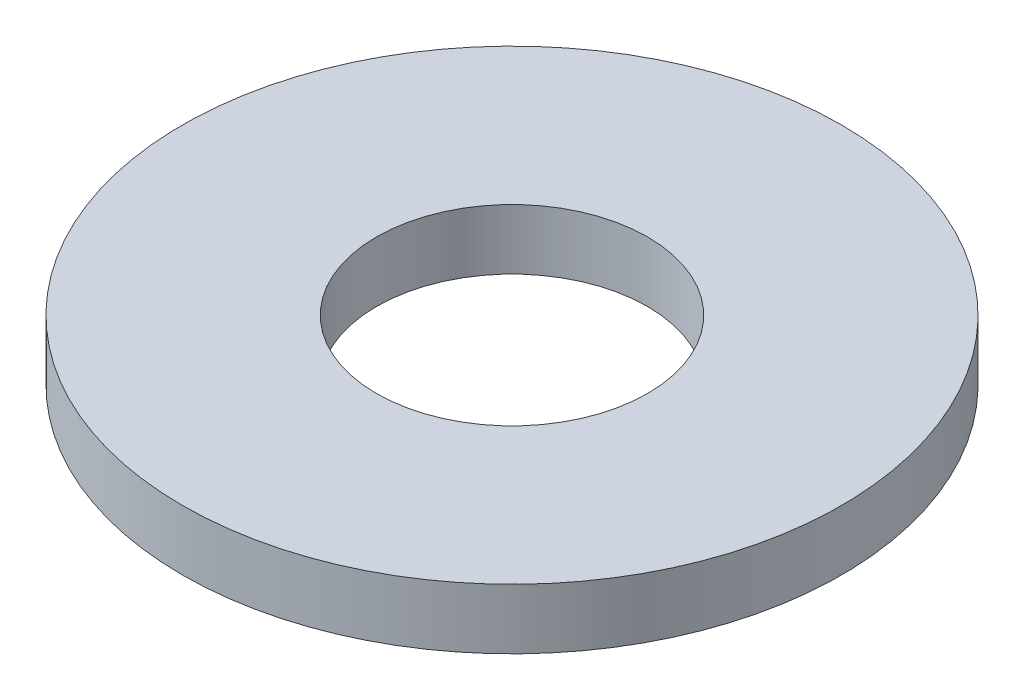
from build123d import *

# Parameters (mm, degrees)
SKETCH1_R           = 5.55625
SKETCH1_R_2         = 2.286
BOSS_EXTRUDE1_DEPTH = 1.016


with BuildPart() as part:
    # Sketch1 → Boss-Extrude1 (new body)
    with BuildSketch(Plane(origin=(0, 0, 0), x_dir=(1, 0, 0), z_dir=(0, 1, 0))):
        with Locations(Location((0, 0, 0), (0, 0, 270))):
            Circle(SKETCH1_R)
        with Locations(Location((0, 0, 0), (0, 0, 270))):
            Circle(SKETCH1_R_2, mode=Mode.SUBTRACT)
    extrude(amount=BOSS_EXTRUDE1_DEPTH)


solid = part.part
